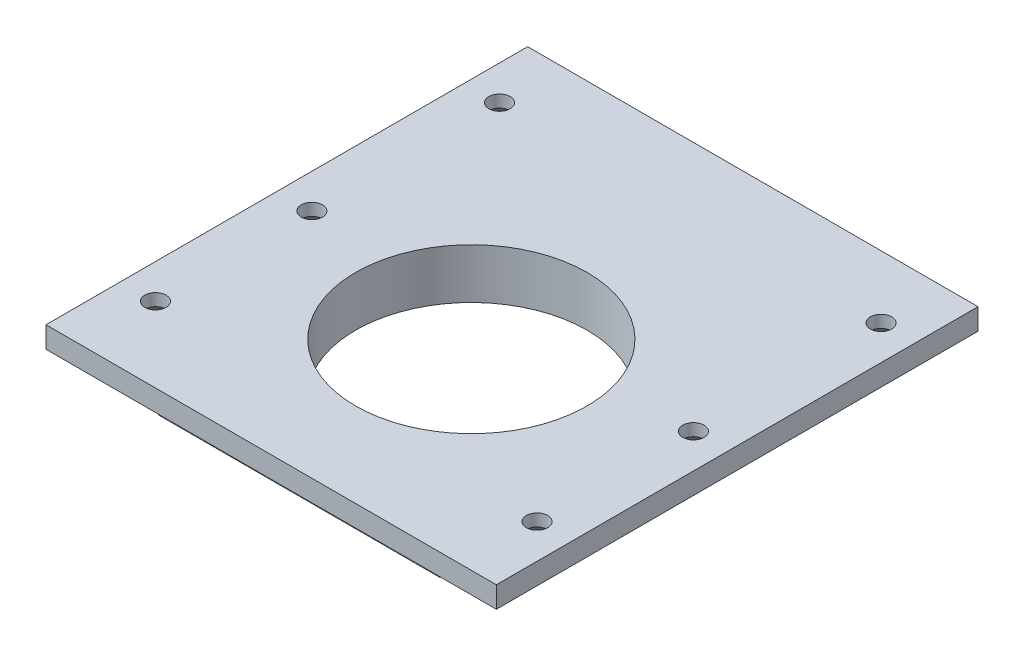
from build123d import *

# Parameters (mm, degrees)
SKETCH1_W                                       = 77
SKETCH1_H                                       = 8
BOSS_EXTRUDE1_DEPTH                             = 36
SKETCH2_R                                       = 18.5
CUT_EXTRUDE1_DEPTH                              = 59.180752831
CUT_EXTRUDE2_DEPTH                              = 86.094065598
SKETCH8_W                                       = 10
SKETCH8_H                                       = 77
CUT_EXTRUDE5_DEPTH                              = 0.1
CUT_EXTRUDE6_REACH                              = 60.181
SKETCH9_W                                       = 52
SKETCH9_H                                       = 4.5
CUT_EXTRUDE7_START                              = -4.6
SKETCH10_W                                      = 52
SKETCH10_H                                      = 17.5
CUT_EXTRUDE7_DEPTH                              = 4.6
F_1_0_1_DIAMETER_HOLE1_D                        = 1
F_1_0_1_DIAMETER_HOLE1_DEPTH                    = 2
F_1_0_1_DIAMETER_HOLE1_TIP                      = 0.30043031
CSK_FOR_M3_FLAT_HEAD_MACHINE_SCREW1_D           = 3.4
CSK_FOR_M3_FLAT_HEAD_MACHINE_SCREW1_CSINK_D     = 6.3
CSK_FOR_M3_FLAT_HEAD_MACHINE_SCREW1_CSINK_ANGLE = 90
CUT_EXTRUDE11_DEPTH                             = 82.04474073
CUT_EXTRUDE15_REACH                             = 60.181


with BuildPart() as part:
    # Sketch1 → Boss-Extrude1 (new, symmetric)
    with BuildSketch(Plane(origin=(0, 0, 0), x_dir=(0, 0, -1), z_dir=(1, 0, 0))):
        with Locations((6.5, 0)):
            Rectangle(SKETCH1_W, SKETCH1_H)
    extrude(amount=BOSS_EXTRUDE1_DEPTH, both=True)

    # Sketch2 → Cut-Extrude1 (cut, through all)
    with BuildSketch(Plane(origin=(0, 4, 0), x_dir=(1, 0, 0), z_dir=(0, 1, 0))):
        with Locations(Location((0, 0, 0), (0, 0, 270))):
            Circle(SKETCH2_R)
    extrude(amount=-CUT_EXTRUDE1_DEPTH, mode=Mode.SUBTRACT)

    # Sketch3 → Cut-Extrude2 (cut, through all)
    with BuildSketch(Plane(origin=(0, 0, -45), x_dir=(-1, 0, 0), z_dir=(0, 0, -1))):
        Polygon((20.401923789, 0.5), (23, -4), (36, -4), (36, 0.5), align=None)
    cut_extrude2 = extrude(amount=-CUT_EXTRUDE2_DEPTH, mode=Mode.SUBTRACT)

    # Sketch8 → Cut-Extrude5 (cut)
    with BuildSketch(Plane.XZ.offset(-0.5)):
        with Locations((-31, -6.5)):
            Rectangle(SKETCH8_W, SKETCH8_H)
    cut_extrude5 = extrude(amount=-CUT_EXTRUDE5_DEPTH, mode=Mode.SUBTRACT)

    # Mirror3: Cut-Extrude2, Cut-Extrude5 across plane
    add(cut_extrude2.mirror(Plane(origin=(0, 0, 0), x_dir=(0, 0, 1), z_dir=(1, 0, 0))), mode=Mode.SUBTRACT)
    add(cut_extrude5.mirror(Plane(origin=(0, 0, 0), x_dir=(0, 0, 1), z_dir=(1, 0, 0))), mode=Mode.SUBTRACT)

    # Cut-Extrude6: up to this face of the body (flat: up to its plane)
    cut_extrude6_end = Plane(part.part.faces().sort_by_distance((-31, 0.6, -6.5))[0])
    # Sketch9 → Cut-Extrude6 (cut, up to the picked face)
    with BuildSketch(Plane.XZ.offset(4), mode=Mode.PRIVATE) as cut_extrude6_sk1:
        with Locations((0, 29.75)):
            Rectangle(SKETCH9_W, SKETCH9_H)
    cut_extrude6_tool1 = split(extrude(cut_extrude6_sk1.sketch, amount=-CUT_EXTRUDE6_REACH, mode=Mode.PRIVATE), bisect_by=cut_extrude6_end, keep=Keep.BOTH, mode=Mode.PRIVATE)
    add(cut_extrude6_tool1.solids().sort_by(Axis((0, -4, 29.75), (0, 1, 0)))[0], mode=Mode.SUBTRACT)

    # Sketch10 → Cut-Extrude7 (cut)
    with BuildSketch(Plane.XZ.offset(4).offset(CUT_EXTRUDE7_START)):
        with Locations((0, -36.25)):
            Rectangle(SKETCH10_W, SKETCH10_H)
    extrude(amount=CUT_EXTRUDE7_DEPTH, mode=Mode.SUBTRACT)

    # 1.0 _1_ Diameter Hole1
    with Locations(Plane(origin=(0, -4, 0), x_dir=(-1, 0, 0), z_dir=(0, -1, 0))):
        with Locations((15, -22.5), (-15, -22.5), (-15, 22.5), (15, 22.5)):
            Hole(F_1_0_1_DIAMETER_HOLE1_D / 2, depth=F_1_0_1_DIAMETER_HOLE1_DEPTH)
            with Locations((0, 0, -(F_1_0_1_DIAMETER_HOLE1_DEPTH + F_1_0_1_DIAMETER_HOLE1_TIP / 2))):  # 118° drill point
                Cone(0, F_1_0_1_DIAMETER_HOLE1_D / 2, F_1_0_1_DIAMETER_HOLE1_TIP, mode=Mode.SUBTRACT)

    # CSK for M3 Flat Head Machine Screw1 (through all)
    with Locations(Plane(origin=(0, 0.6, 0), x_dir=(-1, 0, 0), z_dir=(0, -1, 0))):
        with Locations((30.5, -20), (30.5, 5), (30.5, 35), (-30.5, 35), (-30.5, 5), (-30.5, -20)):
            CounterSinkHole(CSK_FOR_M3_FLAT_HEAD_MACHINE_SCREW1_D / 2, CSK_FOR_M3_FLAT_HEAD_MACHINE_SCREW1_CSINK_D / 2, counter_sink_angle=CSK_FOR_M3_FLAT_HEAD_MACHINE_SCREW1_CSINK_ANGLE)

    # Sketch22 → Cut-Extrude11 (cut, through all)
    with BuildSketch(Plane.XY.offset(27.5)):
        Polygon((22.5, -4), (22.5, -3.133974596), (23, -4), align=None)
        Polygon((-22.5, -4), (-22.5, -3.133974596), (-23, -4), align=None)
    extrude(amount=-CUT_EXTRUDE11_DEPTH, mode=Mode.SUBTRACT)

    # Cut-Extrude15: up to this face of the body (flat: up to its plane)
    cut_extrude15_end = Plane(part.part.faces().sort_by_distance((-23.200961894, 0.5, 0))[0])
    # Sketch29 → Cut-Extrude15 (cut, up to the picked face)
    with BuildSketch(Plane.XZ.offset(4), mode=Mode.PRIVATE) as cut_extrude15_sk1:
        Polygon((-22.5, -27.5), (-22.5, -24.5), (-20.767949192, -27.5), align=None)
    cut_extrude15_tool1 = split(extrude(cut_extrude15_sk1.sketch, amount=-CUT_EXTRUDE15_REACH, mode=Mode.PRIVATE), bisect_by=cut_extrude15_end, keep=Keep.BOTH, mode=Mode.PRIVATE)
    # Sketch29 → Cut-Extrude15 (cut, up to the picked face)
    with BuildSketch(Plane.XZ.offset(4), mode=Mode.PRIVATE) as cut_extrude15_sk2:
        Polygon((22.5, -27.5), (22.5, -24.5), (20.767949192, -27.5), align=None)
    cut_extrude15_tool2 = split(extrude(cut_extrude15_sk2.sketch, amount=-CUT_EXTRUDE15_REACH, mode=Mode.PRIVATE), bisect_by=cut_extrude15_end, keep=Keep.BOTH, mode=Mode.PRIVATE)
    add(cut_extrude15_tool1.solids().sort_by(Axis((-21.92265, -4, -26.5), (0, 1, 0)))[0], mode=Mode.SUBTRACT)
    add(cut_extrude15_tool2.solids().sort_by(Axis((21.92265, -4, -26.5), (0, 1, 0)))[0], mode=Mode.SUBTRACT)


solid = part.part
